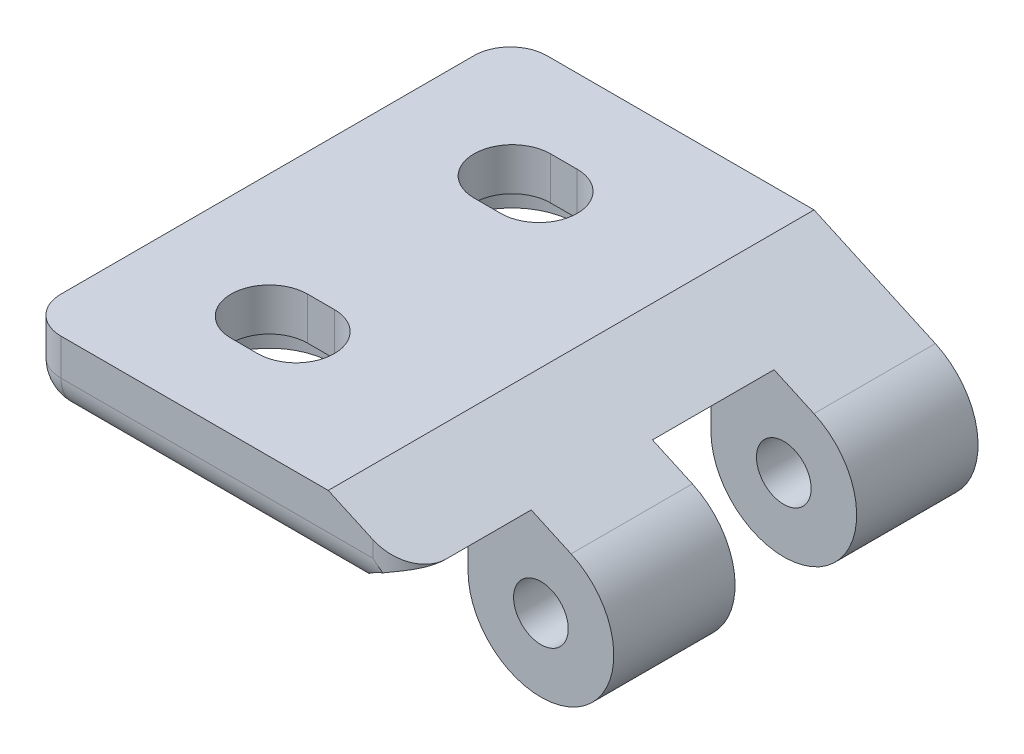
ISO-10303-21;
HEADER;
FILE_DESCRIPTION(('STEP AP214'),'2;1');
FILE_NAME('part.step','',(''),(''),'','','');
FILE_SCHEMA(('AUTOMOTIVE_DESIGN { 1 0 10303 214 1 1 1 1 }'));
ENDSEC;
DATA;
#1=APPLICATION_CONTEXT('core data for automotive mechanical design processes');
#2=APPLICATION_PROTOCOL_DEFINITION('international standard','automotive_design',2000,#1);
#3=PRODUCT_CONTEXT('',#1,'mechanical');
#4=PRODUCT('Part','Part','',(#3));
#5=PRODUCT_RELATED_PRODUCT_CATEGORY('part','',(#4));
#6=PRODUCT_DEFINITION_FORMATION('','',#4);
#7=PRODUCT_DEFINITION_CONTEXT('part definition',#1,'design');
#8=PRODUCT_DEFINITION('design','',#6,#7);
#9=PRODUCT_DEFINITION_SHAPE('','',#8);
#10=(LENGTH_UNIT() NAMED_UNIT(*) SI_UNIT(.MILLI.,.METRE.));
#11=(NAMED_UNIT(*) PLANE_ANGLE_UNIT() SI_UNIT($,.RADIAN.));
#12=(NAMED_UNIT(*) SI_UNIT($,.STERADIAN.) SOLID_ANGLE_UNIT());
#13=UNCERTAINTY_MEASURE_WITH_UNIT(LENGTH_MEASURE(1.E-05),#10,'distance_accuracy_value','');
#14=(GEOMETRIC_REPRESENTATION_CONTEXT(3) GLOBAL_UNCERTAINTY_ASSIGNED_CONTEXT((#13)) GLOBAL_UNIT_ASSIGNED_CONTEXT((#10,
#11,#12)) REPRESENTATION_CONTEXT('',''));
#15=CARTESIAN_POINT('',(0.,0.,0.));
#16=DIRECTION('',(0.,0.,1.));
#17=DIRECTION('',(1.,0.,0.));
#18=AXIS2_PLACEMENT_3D('',#15,#16,#17);
#19=CARTESIAN_POINT('',(21.25,70.0429419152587,10.));
#20=DIRECTION('',(0.,0.,-1.));
#21=DIRECTION('',(-1.,0.,0.));
#22=AXIS2_PLACEMENT_3D('',#19,#20,#21);
#23=CYLINDRICAL_SURFACE('',#22,2.2505);
#24=CARTESIAN_POINT('',(21.25,70.0429419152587,19.99));
#25=DIRECTION('',(0.,0.,-1.));
#26=DIRECTION('',(-1.,0.,0.));
#27=AXIS2_PLACEMENT_3D('',#24,#25,#26);
#28=CIRCLE('',#27,2.2505);
#29=CARTESIAN_POINT('',(18.9995,70.0429419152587,19.99));
#30=VERTEX_POINT('',#29);
#31=EDGE_CURVE('E377',#30,#30,#28,.F.);
#32=ORIENTED_EDGE('',*,*,#31,.T.);
#33=EDGE_LOOP('',(#32));
#34=FACE_BOUND('',#33,.T.);
#35=CARTESIAN_POINT('',(21.25,70.0429419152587,10.005));
#36=DIRECTION('',(0.,0.,-1.));
#37=DIRECTION('',(-1.,0.,0.));
#38=AXIS2_PLACEMENT_3D('',#35,#36,#37);
#39=CIRCLE('',#38,2.2505);
#40=CARTESIAN_POINT('',(18.9995,70.0429419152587,10.005));
#41=VERTEX_POINT('',#40);
#42=EDGE_CURVE('E639',#41,#41,#39,.T.);
#43=ORIENTED_EDGE('',*,*,#42,.T.);
#44=EDGE_LOOP('',(#43));
#45=FACE_BOUND('',#44,.T.);
#46=ADVANCED_FACE('F16',(#34,#45),#23,.F.);
#47=CARTESIAN_POINT('',(24.25,72.0429419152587,27.));
#48=DIRECTION('',(0.,0.,-1.));
#49=DIRECTION('',(-1.,0.,0.));
#50=AXIS2_PLACEMENT_3D('',#47,#48,#49);
#51=PLANE('',#50);
#52=DIRECTION('',(-1.,0.,0.));
#53=VECTOR('',#52,1.);
#54=CARTESIAN_POINT('',(24.25,74.0429419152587,27.));
#55=LINE('',#54,#53);
#56=CARTESIAN_POINT('',(15.25,74.0429419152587,27.));
#57=VERTEX_POINT('',#56);
#58=CARTESIAN_POINT('',(15.505437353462,74.0429419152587,27.));
#59=VERTEX_POINT('',#58);
#60=EDGE_CURVE('E274',#57,#59,#55,.F.);
#61=ORIENTED_EDGE('',*,*,#60,.F.);
#62=DIRECTION('',(0.,1.,0.));
#63=VECTOR('',#62,1.);
#64=CARTESIAN_POINT('',(15.25,74.0429419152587,27.));
#65=LINE('',#64,#63);
#66=CARTESIAN_POINT('',(15.25,73.6484931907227,27.));
#67=VERTEX_POINT('',#66);
#68=EDGE_CURVE('E253',#67,#57,#65,.T.);
#69=ORIENTED_EDGE('',*,*,#68,.F.);
#70=CARTESIAN_POINT('',(21.25,70.0429419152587,27.));
#71=DIRECTION('',(0.,0.,-1.));
#72=DIRECTION('',(-1.,0.,0.));
#73=AXIS2_PLACEMENT_3D('',#70,#71,#72);
#74=CIRCLE('',#73,7.);
#75=EDGE_CURVE('E597',#67,#59,#74,.T.);
#76=ORIENTED_EDGE('',*,*,#75,.T.);
#77=EDGE_LOOP('',(#61,#69,#76));
#78=FACE_BOUND('',#77,.T.);
#79=ADVANCED_FACE('F479',(#78),#51,.F.);
#80=CARTESIAN_POINT('',(-8.25,74.0429419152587,30.));
#81=DIRECTION('',(0.,-1.,0.));
#82=DIRECTION('',(0.,0.,-1.));
#83=AXIS2_PLACEMENT_3D('',#80,#81,#82);
#84=PLANE('',#83);
#85=CARTESIAN_POINT('',(1.1,74.0429419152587,20.));
#86=DIRECTION('',(0.,-1.,0.));
#87=DIRECTION('',(0.,0.,-1.));
#88=AXIS2_PLACEMENT_3D('',#85,#86,#87);
#89=CIRCLE('',#88,5.25);
#90=CARTESIAN_POINT('',(1.1,74.0429419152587,25.25));
#91=VERTEX_POINT('',#90);
#92=CARTESIAN_POINT('',(1.1,74.0429419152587,14.75));
#93=VERTEX_POINT('',#92);
#94=EDGE_CURVE('E801',#91,#93,#89,.F.);
#95=ORIENTED_EDGE('',*,*,#94,.T.);
#96=DIRECTION('',(-1.,0.,0.));
#97=VECTOR('',#96,1.);
#98=CARTESIAN_POINT('',(1.1,74.0429419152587,14.75));
#99=LINE('',#98,#97);
#100=CARTESIAN_POINT('',(-1.1,74.0429419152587,14.75));
#101=VERTEX_POINT('',#100);
#102=EDGE_CURVE('E289',#93,#101,#99,.T.);
#103=ORIENTED_EDGE('',*,*,#102,.T.);
#104=CARTESIAN_POINT('',(-1.1,74.0429419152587,20.));
#105=DIRECTION('',(0.,-1.,0.));
#106=DIRECTION('',(0.,0.,-1.));
#107=AXIS2_PLACEMENT_3D('',#104,#105,#106);
#108=CIRCLE('',#107,5.25);
#109=CARTESIAN_POINT('',(-1.1,74.0429419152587,25.25));
#110=VERTEX_POINT('',#109);
#111=EDGE_CURVE('E295',#101,#110,#108,.F.);
#112=ORIENTED_EDGE('',*,*,#111,.T.);
#113=DIRECTION('',(1.,0.,0.));
#114=VECTOR('',#113,1.);
#115=CARTESIAN_POINT('',(-1.1,74.0429419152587,25.25));
#116=LINE('',#115,#114);
#117=EDGE_CURVE('E285',#110,#91,#116,.T.);
#118=ORIENTED_EDGE('',*,*,#117,.T.);
#119=EDGE_LOOP('',(#95,#103,#112,#118));
#120=FACE_BOUND('',#119,.T.);
#121=CARTESIAN_POINT('',(1.1,74.0429419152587,0.));
#122=DIRECTION('',(0.,-1.,0.));
#123=DIRECTION('',(0.,0.,-1.));
#124=AXIS2_PLACEMENT_3D('',#121,#122,#123);
#125=CIRCLE('',#124,5.25);
#126=CARTESIAN_POINT('',(1.1,74.0429419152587,5.24999999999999));
#127=VERTEX_POINT('',#126);
#128=CARTESIAN_POINT('',(1.1,74.0429419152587,-5.25000000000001));
#129=VERTEX_POINT('',#128);
#130=EDGE_CURVE('E225',#127,#129,#125,.F.);
#131=ORIENTED_EDGE('',*,*,#130,.T.);
#132=DIRECTION('',(-1.,0.,0.));
#133=VECTOR('',#132,1.);
#134=CARTESIAN_POINT('',(1.10000000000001,74.0429419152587,-5.25000000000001));
#135=LINE('',#134,#133);
#136=CARTESIAN_POINT('',(-1.09999999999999,74.0429419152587,-5.25000000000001));
#137=VERTEX_POINT('',#136);
#138=EDGE_CURVE('E222',#129,#137,#135,.T.);
#139=ORIENTED_EDGE('',*,*,#138,.T.);
#140=CARTESIAN_POINT('',(-1.09999999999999,74.0429419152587,0.));
#141=DIRECTION('',(0.,-1.,0.));
#142=DIRECTION('',(0.,0.,-1.));
#143=AXIS2_PLACEMENT_3D('',#140,#141,#142);
#144=CIRCLE('',#143,5.25);
#145=CARTESIAN_POINT('',(-1.09999999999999,74.0429419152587,5.24999999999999));
#146=VERTEX_POINT('',#145);
#147=EDGE_CURVE('E19',#137,#146,#144,.F.);
#148=ORIENTED_EDGE('',*,*,#147,.T.);
#149=DIRECTION('',(1.,0.,0.));
#150=VECTOR('',#149,1.);
#151=CARTESIAN_POINT('',(-1.09999999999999,74.0429419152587,5.24999999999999));
#152=LINE('',#151,#150);
#153=EDGE_CURVE('E294',#146,#127,#152,.T.);
#154=ORIENTED_EDGE('',*,*,#153,.T.);
#155=EDGE_LOOP('',(#131,#139,#148,#154));
#156=FACE_BOUND('',#155,.T.);
#157=DIRECTION('',(-1.,0.,0.));
#158=VECTOR('',#157,1.);
#159=CARTESIAN_POINT('',(24.25,74.0429419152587,27.));
#160=LINE('',#159,#158);
#161=CARTESIAN_POINT('',(-8.25,74.0429419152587,26.9999999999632));
#162=VERTEX_POINT('',#161);
#163=EDGE_CURVE('E271',#162,#57,#160,.F.);
#164=ORIENTED_EDGE('',*,*,#163,.F.);
#165=DIRECTION('',(0.,0.,-1.));
#166=VECTOR('',#165,1.);
#167=CARTESIAN_POINT('',(-8.25,74.0429419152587,30.));
#168=LINE('',#167,#166);
#169=CARTESIAN_POINT('',(-8.25,74.0429419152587,-7.));
#170=VERTEX_POINT('',#169);
#171=EDGE_CURVE('E278',#170,#162,#168,.F.);
#172=ORIENTED_EDGE('',*,*,#171,.F.);
#173=DIRECTION('',(-1.,0.,0.));
#174=VECTOR('',#173,1.);
#175=CARTESIAN_POINT('',(15.25,74.0429419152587,-7.));
#176=LINE('',#175,#174);
#177=CARTESIAN_POINT('',(15.25,74.0429419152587,-7.));
#178=VERTEX_POINT('',#177);
#179=EDGE_CURVE('E243',#178,#170,#176,.T.);
#180=ORIENTED_EDGE('',*,*,#179,.F.);
#181=DIRECTION('',(0.,0.,1.));
#182=VECTOR('',#181,1.);
#183=CARTESIAN_POINT('',(15.25,74.0429419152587,30.));
#184=LINE('',#183,#182);
#185=EDGE_CURVE('E242',#57,#178,#184,.F.);
#186=ORIENTED_EDGE('',*,*,#185,.F.);
#187=EDGE_LOOP('',(#164,#172,#180,#186));
#188=FACE_BOUND('',#187,.T.);
#189=ADVANCED_FACE('F223',(#120,#156,#188),#84,.T.);
#190=CARTESIAN_POINT('',(-1.09999999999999,76.5429419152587,0.));
#191=DIRECTION('',(0.,-1.,0.));
#192=DIRECTION('',(0.,0.,-1.));
#193=AXIS2_PLACEMENT_3D('',#190,#191,#192);
#194=CYLINDRICAL_SURFACE('',#193,5.25);
#195=DIRECTION('',(0.,1.,0.));
#196=VECTOR('',#195,1.);
#197=CARTESIAN_POINT('',(-1.09999999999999,76.5429419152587,-5.25000000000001));
#198=LINE('',#197,#196);
#199=CARTESIAN_POINT('',(-1.09999999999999,76.5429419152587,-5.25000000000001));
#200=VERTEX_POINT('',#199);
#201=EDGE_CURVE('E214',#137,#200,#198,.T.);
#202=ORIENTED_EDGE('',*,*,#201,.T.);
#203=CARTESIAN_POINT('',(-1.09999999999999,76.5429419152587,0.));
#204=DIRECTION('',(0.,-1.,0.));
#205=DIRECTION('',(0.,0.,-1.));
#206=AXIS2_PLACEMENT_3D('',#203,#204,#205);
#207=CIRCLE('',#206,5.25);
#208=CARTESIAN_POINT('',(-1.09999999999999,76.5429419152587,5.25));
#209=VERTEX_POINT('',#208);
#210=EDGE_CURVE('E363',#209,#200,#207,.T.);
#211=ORIENTED_EDGE('',*,*,#210,.F.);
#212=DIRECTION('',(0.,1.,0.));
#213=VECTOR('',#212,1.);
#214=CARTESIAN_POINT('',(-1.09999999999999,76.5429419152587,5.24999999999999));
#215=LINE('',#214,#213);
#216=EDGE_CURVE('E217',#209,#146,#215,.F.);
#217=ORIENTED_EDGE('',*,*,#216,.T.);
#218=ORIENTED_EDGE('',*,*,#147,.F.);
#219=EDGE_LOOP('',(#202,#211,#217,#218));
#220=FACE_BOUND('',#219,.T.);
#221=ADVANCED_FACE('F212',(#220),#194,.F.);
#222=CARTESIAN_POINT('',(1.10000000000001,76.5429419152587,-5.25000000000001));
#223=DIRECTION('',(0.,0.,-1.));
#224=DIRECTION('',(-1.,0.,0.));
#225=AXIS2_PLACEMENT_3D('',#222,#223,#224);
#226=PLANE('',#225);
#227=DIRECTION('',(0.,-1.,0.));
#228=VECTOR('',#227,1.);
#229=CARTESIAN_POINT('',(1.1,76.5429419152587,-5.25000000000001));
#230=LINE('',#229,#228);
#231=CARTESIAN_POINT('',(1.1,76.5429419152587,-5.25000000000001));
#232=VERTEX_POINT('',#231);
#233=EDGE_CURVE('E228',#129,#232,#230,.F.);
#234=ORIENTED_EDGE('',*,*,#233,.T.);
#235=DIRECTION('',(1.,0.,0.));
#236=VECTOR('',#235,1.);
#237=CARTESIAN_POINT('',(0.,76.5429419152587,-5.25));
#238=LINE('',#237,#236);
#239=EDGE_CURVE('E232',#200,#232,#238,.T.);
#240=ORIENTED_EDGE('',*,*,#239,.F.);
#241=ORIENTED_EDGE('',*,*,#201,.F.);
#242=ORIENTED_EDGE('',*,*,#138,.F.);
#243=EDGE_LOOP('',(#234,#240,#241,#242));
#244=FACE_BOUND('',#243,.T.);
#245=ADVANCED_FACE('F230',(#244),#226,.F.);
#246=CARTESIAN_POINT('',(1.1,76.5429419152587,0.));
#247=DIRECTION('',(0.,-1.,0.));
#248=DIRECTION('',(0.,0.,-1.));
#249=AXIS2_PLACEMENT_3D('',#246,#247,#248);
#250=CYLINDRICAL_SURFACE('',#249,5.25);
#251=DIRECTION('',(0.,1.,0.));
#252=VECTOR('',#251,1.);
#253=CARTESIAN_POINT('',(1.1,76.5429419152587,5.24999999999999));
#254=LINE('',#253,#252);
#255=CARTESIAN_POINT('',(1.1,76.5429419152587,5.25));
#256=VERTEX_POINT('',#255);
#257=EDGE_CURVE('E808',#127,#256,#254,.T.);
#258=ORIENTED_EDGE('',*,*,#257,.T.);
#259=CARTESIAN_POINT('',(1.1,76.5429419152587,0.));
#260=DIRECTION('',(0.,-1.,0.));
#261=DIRECTION('',(0.,0.,-1.));
#262=AXIS2_PLACEMENT_3D('',#259,#260,#261);
#263=CIRCLE('',#262,5.25);
#264=EDGE_CURVE('E360',#232,#256,#263,.T.);
#265=ORIENTED_EDGE('',*,*,#264,.F.);
#266=ORIENTED_EDGE('',*,*,#233,.F.);
#267=ORIENTED_EDGE('',*,*,#130,.F.);
#268=EDGE_LOOP('',(#258,#265,#266,#267));
#269=FACE_BOUND('',#268,.T.);
#270=ADVANCED_FACE('F469',(#269),#250,.F.);
#271=CARTESIAN_POINT('',(-1.09999999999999,76.5429419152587,5.24999999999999));
#272=DIRECTION('',(0.,0.,1.));
#273=DIRECTION('',(1.,0.,0.));
#274=AXIS2_PLACEMENT_3D('',#271,#272,#273);
#275=PLANE('',#274);
#276=ORIENTED_EDGE('',*,*,#216,.F.);
#277=DIRECTION('',(1.,0.,0.));
#278=VECTOR('',#277,1.);
#279=CARTESIAN_POINT('',(0.,76.5429419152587,5.25));
#280=LINE('',#279,#278);
#281=EDGE_CURVE('E359',#256,#209,#280,.F.);
#282=ORIENTED_EDGE('',*,*,#281,.F.);
#283=ORIENTED_EDGE('',*,*,#257,.F.);
#284=ORIENTED_EDGE('',*,*,#153,.F.);
#285=EDGE_LOOP('',(#276,#282,#283,#284));
#286=FACE_BOUND('',#285,.T.);
#287=ADVANCED_FACE('F465',(#286),#275,.F.);
#288=CARTESIAN_POINT('',(-1.1,76.5429419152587,20.));
#289=DIRECTION('',(0.,-1.,0.));
#290=DIRECTION('',(0.,0.,-1.));
#291=AXIS2_PLACEMENT_3D('',#288,#289,#290);
#292=CYLINDRICAL_SURFACE('',#291,5.25);
#293=DIRECTION('',(0.,1.,0.));
#294=VECTOR('',#293,1.);
#295=CARTESIAN_POINT('',(-1.1,76.5429419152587,14.75));
#296=LINE('',#295,#294);
#297=CARTESIAN_POINT('',(-1.1,76.5429419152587,14.75));
#298=VERTEX_POINT('',#297);
#299=EDGE_CURVE('E293',#101,#298,#296,.T.);
#300=ORIENTED_EDGE('',*,*,#299,.T.);
#301=CARTESIAN_POINT('',(-1.1,76.5429419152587,20.));
#302=DIRECTION('',(0.,-1.,0.));
#303=DIRECTION('',(0.,0.,-1.));
#304=AXIS2_PLACEMENT_3D('',#301,#302,#303);
#305=CIRCLE('',#304,5.25);
#306=CARTESIAN_POINT('',(-1.1,76.5429419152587,25.25));
#307=VERTEX_POINT('',#306);
#308=EDGE_CURVE('E356',#307,#298,#305,.T.);
#309=ORIENTED_EDGE('',*,*,#308,.F.);
#310=DIRECTION('',(0.,1.,0.));
#311=VECTOR('',#310,1.);
#312=CARTESIAN_POINT('',(-1.1,76.5429419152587,25.25));
#313=LINE('',#312,#311);
#314=EDGE_CURVE('E288',#307,#110,#313,.F.);
#315=ORIENTED_EDGE('',*,*,#314,.T.);
#316=ORIENTED_EDGE('',*,*,#111,.F.);
#317=EDGE_LOOP('',(#300,#309,#315,#316));
#318=FACE_BOUND('',#317,.T.);
#319=ADVANCED_FACE('F461',(#318),#292,.F.);
#320=CARTESIAN_POINT('',(1.1,76.5429419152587,14.75));
#321=DIRECTION('',(0.,0.,-1.));
#322=DIRECTION('',(-1.,0.,0.));
#323=AXIS2_PLACEMENT_3D('',#320,#321,#322);
#324=PLANE('',#323);
#325=DIRECTION('',(0.,-1.,0.));
#326=VECTOR('',#325,1.);
#327=CARTESIAN_POINT('',(1.1,76.5429419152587,14.75));
#328=LINE('',#327,#326);
#329=CARTESIAN_POINT('',(1.1,76.5429419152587,14.75));
#330=VERTEX_POINT('',#329);
#331=EDGE_CURVE('E292',#93,#330,#328,.F.);
#332=ORIENTED_EDGE('',*,*,#331,.T.);
#333=DIRECTION('',(1.,0.,0.));
#334=VECTOR('',#333,1.);
#335=CARTESIAN_POINT('',(0.,76.5429419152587,14.75));
#336=LINE('',#335,#334);
#337=EDGE_CURVE('E355',#298,#330,#336,.T.);
#338=ORIENTED_EDGE('',*,*,#337,.F.);
#339=ORIENTED_EDGE('',*,*,#299,.F.);
#340=ORIENTED_EDGE('',*,*,#102,.F.);
#341=EDGE_LOOP('',(#332,#338,#339,#340));
#342=FACE_BOUND('',#341,.T.);
#343=ADVANCED_FACE('F457',(#342),#324,.F.);
#344=CARTESIAN_POINT('',(1.1,76.5429419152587,20.));
#345=DIRECTION('',(0.,-1.,0.));
#346=DIRECTION('',(0.,0.,-1.));
#347=AXIS2_PLACEMENT_3D('',#344,#345,#346);
#348=CYLINDRICAL_SURFACE('',#347,5.25);
#349=DIRECTION('',(0.,1.,0.));
#350=VECTOR('',#349,1.);
#351=CARTESIAN_POINT('',(1.1,76.5429419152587,25.25));
#352=LINE('',#351,#350);
#353=CARTESIAN_POINT('',(1.1,76.5429419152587,25.25));
#354=VERTEX_POINT('',#353);
#355=EDGE_CURVE('E444',#91,#354,#352,.T.);
#356=ORIENTED_EDGE('',*,*,#355,.T.);
#357=CARTESIAN_POINT('',(1.1,76.5429419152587,20.));
#358=DIRECTION('',(0.,-1.,0.));
#359=DIRECTION('',(0.,0.,-1.));
#360=AXIS2_PLACEMENT_3D('',#357,#358,#359);
#361=CIRCLE('',#360,5.25);
#362=EDGE_CURVE('E351',#330,#354,#361,.T.);
#363=ORIENTED_EDGE('',*,*,#362,.F.);
#364=ORIENTED_EDGE('',*,*,#331,.F.);
#365=ORIENTED_EDGE('',*,*,#94,.F.);
#366=EDGE_LOOP('',(#356,#363,#364,#365));
#367=FACE_BOUND('',#366,.T.);
#368=ADVANCED_FACE('F453',(#367),#348,.F.);
#369=CARTESIAN_POINT('',(-1.1,76.5429419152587,25.25));
#370=DIRECTION('',(0.,0.,1.));
#371=DIRECTION('',(1.,0.,0.));
#372=AXIS2_PLACEMENT_3D('',#369,#370,#371);
#373=PLANE('',#372);
#374=ORIENTED_EDGE('',*,*,#314,.F.);
#375=DIRECTION('',(1.,0.,0.));
#376=VECTOR('',#375,1.);
#377=CARTESIAN_POINT('',(0.,76.5429419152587,25.25));
#378=LINE('',#377,#376);
#379=EDGE_CURVE('E354',#354,#307,#378,.F.);
#380=ORIENTED_EDGE('',*,*,#379,.F.);
#381=ORIENTED_EDGE('',*,*,#355,.F.);
#382=ORIENTED_EDGE('',*,*,#117,.F.);
#383=EDGE_LOOP('',(#374,#380,#381,#382));
#384=FACE_BOUND('',#383,.T.);
#385=ADVANCED_FACE('F449',(#384),#373,.F.);
#386=CARTESIAN_POINT('',(-8.25,77.0429419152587,-7.));
#387=DIRECTION('',(-1.,0.,0.));
#388=DIRECTION('',(0.,1.,0.));
#389=AXIS2_PLACEMENT_3D('',#386,#387,#388);
#390=SPHERICAL_SURFACE('',#389,3.);
#391=CARTESIAN_POINT('',(-8.25,77.0429419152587,-7.00000000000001));
#392=DIRECTION('',(0.,-1.,0.));
#393=DIRECTION('',(1.,0.,0.));
#394=AXIS2_PLACEMENT_3D('',#391,#392,#393);
#395=CIRCLE('',#394,3.);
#396=CARTESIAN_POINT('',(-8.25,77.0429419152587,-10.));
#397=VERTEX_POINT('',#396);
#398=CARTESIAN_POINT('',(-11.25,77.0429419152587,-7.));
#399=VERTEX_POINT('',#398);
#400=EDGE_CURVE('E650',#397,#399,#395,.F.);
#401=ORIENTED_EDGE('',*,*,#400,.F.);
#402=CARTESIAN_POINT('',(-8.25,77.0429419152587,-7.));
#403=DIRECTION('',(-1.,0.,0.));
#404=DIRECTION('',(0.,0.,1.));
#405=AXIS2_PLACEMENT_3D('',#402,#403,#404);
#406=CIRCLE('',#405,3.);
#407=EDGE_CURVE('E252',#170,#397,#406,.F.);
#408=ORIENTED_EDGE('',*,*,#407,.F.);
#409=CARTESIAN_POINT('',(-8.25,77.0429419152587,-7.));
#410=DIRECTION('',(0.,0.,-1.));
#411=DIRECTION('',(-1.,0.,0.));
#412=AXIS2_PLACEMENT_3D('',#409,#410,#411);
#413=CIRCLE('',#412,3.);
#414=EDGE_CURVE('E282',#399,#170,#413,.F.);
#415=ORIENTED_EDGE('',*,*,#414,.F.);
#416=EDGE_LOOP('',(#401,#408,#415));
#417=FACE_BOUND('',#416,.T.);
#418=ADVANCED_FACE('F446',(#417),#390,.T.);
#419=CARTESIAN_POINT('',(-8.25,77.0429419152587,30.));
#420=DIRECTION('',(0.,0.,-1.));
#421=DIRECTION('',(-1.,0.,0.));
#422=AXIS2_PLACEMENT_3D('',#419,#420,#421);
#423=CYLINDRICAL_SURFACE('',#422,3.);
#424=CARTESIAN_POINT('',(-8.25,77.0429419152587,27.));
#425=DIRECTION('',(0.,-4.90653188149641E-11,1.));
#426=DIRECTION('',(-1.,0.,0.));
#427=AXIS2_PLACEMENT_3D('',#424,#425,#426);
#428=CIRCLE('',#427,3.);
#429=CARTESIAN_POINT('',(-11.25,77.0429419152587,27.));
#430=VERTEX_POINT('',#429);
#431=EDGE_CURVE('E281',#430,#162,#428,.T.);
#432=ORIENTED_EDGE('',*,*,#431,.F.);
#433=DIRECTION('',(0.,0.,1.));
#434=VECTOR('',#433,1.);
#435=CARTESIAN_POINT('',(-11.25,77.0429419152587,30.));
#436=LINE('',#435,#434);
#437=EDGE_CURVE('E634',#399,#430,#436,.T.);
#438=ORIENTED_EDGE('',*,*,#437,.F.);
#439=ORIENTED_EDGE('',*,*,#414,.T.);
#440=ORIENTED_EDGE('',*,*,#171,.T.);
#441=EDGE_LOOP('',(#432,#438,#439,#440));
#442=FACE_BOUND('',#441,.T.);
#443=ADVANCED_FACE('F426',(#442),#423,.T.);
#444=CARTESIAN_POINT('',(-8.25,77.0429419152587,27.));
#445=DIRECTION('',(-1.,0.,0.));
#446=DIRECTION('',(0.,1.,0.));
#447=AXIS2_PLACEMENT_3D('',#444,#445,#446);
#448=SPHERICAL_SURFACE('',#447,3.);
#449=CARTESIAN_POINT('',(-8.25,77.0429419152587,27.));
#450=DIRECTION('',(-1.,0.,0.));
#451=DIRECTION('',(0.,0.,1.));
#452=AXIS2_PLACEMENT_3D('',#449,#450,#451);
#453=CIRCLE('',#452,3.);
#454=CARTESIAN_POINT('',(-8.25,77.0429419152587,30.));
#455=VERTEX_POINT('',#454);
#456=EDGE_CURVE('E275',#455,#162,#453,.F.);
#457=ORIENTED_EDGE('',*,*,#456,.F.);
#458=CARTESIAN_POINT('',(-8.25,77.0429419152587,27.));
#459=DIRECTION('',(0.,-1.,0.));
#460=DIRECTION('',(0.,0.,-1.));
#461=AXIS2_PLACEMENT_3D('',#458,#459,#460);
#462=CIRCLE('',#461,3.);
#463=EDGE_CURVE('E631',#430,#455,#462,.F.);
#464=ORIENTED_EDGE('',*,*,#463,.F.);
#465=ORIENTED_EDGE('',*,*,#431,.T.);
#466=EDGE_LOOP('',(#457,#464,#465));
#467=FACE_BOUND('',#466,.T.);
#468=ADVANCED_FACE('F421',(#467),#448,.T.);
#469=CARTESIAN_POINT('',(24.25,77.0429419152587,27.));
#470=DIRECTION('',(-1.,0.,0.));
#471=DIRECTION('',(0.,0.,1.));
#472=AXIS2_PLACEMENT_3D('',#469,#470,#471);
#473=CYLINDRICAL_SURFACE('',#472,3.);
#474=ORIENTED_EDGE('',*,*,#163,.T.);
#475=ORIENTED_EDGE('',*,*,#60,.T.);
#476=CARTESIAN_POINT('',(15.505437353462,74.0429419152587,27.));
#477=CARTESIAN_POINT('',(15.5054388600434,74.0429294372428,27.0708599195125));
#478=CARTESIAN_POINT('',(15.5071855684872,74.0454522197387,27.141715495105));
#479=CARTESIAN_POINT('',(15.5141783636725,74.0554745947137,27.2828896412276));
#480=CARTESIAN_POINT('',(15.5194239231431,74.0629734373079,27.3532082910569));
#481=CARTESIAN_POINT('',(15.5334042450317,74.0828270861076,27.4926110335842));
#482=CARTESIAN_POINT('',(15.54212942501,74.0951685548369,27.5616979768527));
#483=CARTESIAN_POINT('',(15.5630742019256,74.1245099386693,27.698315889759));
#484=CARTESIAN_POINT('',(15.5752938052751,74.1415098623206,27.7658468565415));
#485=CARTESIAN_POINT('',(15.6172237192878,74.199156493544,27.9653950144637));
#486=CARTESIAN_POINT('',(15.6522167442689,74.246467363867,28.0944855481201));
#487=CARTESIAN_POINT('',(15.7361960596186,74.3560255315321,28.341171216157));
#488=CARTESIAN_POINT('',(15.7851856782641,74.4182763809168,28.4587636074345));
#489=CARTESIAN_POINT('',(15.8979214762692,74.5555111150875,28.6823314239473));
#490=CARTESIAN_POINT('',(15.9619489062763,74.6307293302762,28.7880201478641));
#491=CARTESIAN_POINT('',(16.1032961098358,74.7887437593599,28.983532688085));
#492=CARTESIAN_POINT('',(16.1806134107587,74.8715385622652,29.0733594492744));
#493=CARTESIAN_POINT('',(16.3200767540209,75.0130828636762,29.210428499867));
#494=CARTESIAN_POINT('',(16.3789854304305,75.0709007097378,29.2620221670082));
#495=CARTESIAN_POINT('',(16.5018144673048,75.1870522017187,29.3582532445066));
#496=CARTESIAN_POINT('',(16.5657363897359,75.2453860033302,29.4028884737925));
#497=CARTESIAN_POINT('',(16.6983612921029,75.3618146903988,29.4857477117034));
#498=CARTESIAN_POINT('',(16.7670830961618,75.4199075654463,29.5239442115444));
#499=CARTESIAN_POINT('',(16.9086060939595,75.5348096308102,29.5942386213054));
#500=CARTESIAN_POINT('',(16.981408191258,75.5916185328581,29.6263351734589));
#501=CARTESIAN_POINT('',(17.1411416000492,75.7111498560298,29.6891467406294));
#502=CARTESIAN_POINT('',(17.2286187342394,75.7735782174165,29.719030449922));
#503=CARTESIAN_POINT('',(17.4076998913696,75.8951599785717,29.7725455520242));
#504=CARTESIAN_POINT('',(17.4993057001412,75.954311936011,29.7961742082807));
#505=CARTESIAN_POINT('',(17.6851139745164,76.0681662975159,29.8378614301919));
#506=CARTESIAN_POINT('',(17.779280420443,76.122907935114,29.855974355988));
#507=CARTESIAN_POINT('',(17.9705319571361,76.228169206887,29.8877566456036));
#508=CARTESIAN_POINT('',(18.0676134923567,76.2786937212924,29.9014312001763));
#509=CARTESIAN_POINT('',(18.1659846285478,76.3269572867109,29.9133084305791));
#510=B_SPLINE_CURVE_WITH_KNOTS('',3,(#476,#477,#478,#479,#480,#481,#482,#483,#484,#485,#486,
#487,#488,#489,#490,#491,#492,#493,#494,#495,#496,#497,#498,#499,#500,#501,#502,#503,#504,#505,
#506,#507,#508,#509),.UNSPECIFIED.,.F.,.F.,(4,2,2,2,2,2,2,2,2,2,2,2,2,2,2,2,4),(0.,
0.212505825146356,0.424979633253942,0.636872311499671,0.848765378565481,1.2721964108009,
1.69572821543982,2.12792013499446,2.56003173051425,2.85169000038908,3.14343950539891,
3.4364055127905,3.72943665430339,4.06374015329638,4.39818966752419,4.72922756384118,
5.05987689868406),.UNSPECIFIED.);
#511=CARTESIAN_POINT('',(18.1659846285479,76.3269572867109,29.9133084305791));
#512=VERTEX_POINT('',#511);
#513=EDGE_CURVE('E385',#59,#512,#510,.T.);
#514=ORIENTED_EDGE('',*,*,#513,.T.);
#515=CARTESIAN_POINT('',(17.45,77.0429419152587,27.));
#516=DIRECTION('',(-0.707106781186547,-0.707106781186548,0.));
#517=DIRECTION('',(0.707106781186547,-0.707106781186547,0.));
#518=AXIS2_PLACEMENT_3D('',#515,#516,#517);
#519=ELLIPSE('',#518,4.24264068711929,3.);
#520=CARTESIAN_POINT('',(17.45,77.0429419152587,30.));
#521=VERTEX_POINT('',#520);
#522=EDGE_CURVE('E759',#521,#512,#519,.F.);
#523=ORIENTED_EDGE('',*,*,#522,.F.);
#524=DIRECTION('',(-1.,0.,0.));
#525=VECTOR('',#524,1.);
#526=CARTESIAN_POINT('',(8.98147180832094,77.0429419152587,30.));
#527=LINE('',#526,#525);
#528=EDGE_CURVE('E625',#521,#455,#527,.T.);
#529=ORIENTED_EDGE('',*,*,#528,.T.);
#530=ORIENTED_EDGE('',*,*,#456,.T.);
#531=EDGE_LOOP('',(#474,#475,#514,#523,#529,#530));
#532=FACE_BOUND('',#531,.T.);
#533=ADVANCED_FACE('F416',(#532),#473,.T.);
#534=CARTESIAN_POINT('',(21.25,70.0429419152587,10.005));
#535=DIRECTION('',(0.,0.,1.));
#536=DIRECTION('',(1.,0.,0.));
#537=AXIS2_PLACEMENT_3D('',#534,#535,#536);
#538=PLANE('',#537);
#539=ORIENTED_EDGE('',*,*,#42,.F.);
#540=EDGE_LOOP('',(#539));
#541=FACE_BOUND('',#540,.T.);
#542=CARTESIAN_POINT('',(21.25,70.0429419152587,10.005));
#543=DIRECTION('',(0.,0.,-1.));
#544=DIRECTION('',(-1.,0.,0.));
#545=AXIS2_PLACEMENT_3D('',#542,#543,#544);
#546=CIRCLE('',#545,6.);
#547=CARTESIAN_POINT('',(15.25,70.0429419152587,10.005));
#548=VERTEX_POINT('',#547);
#549=CARTESIAN_POINT('',(23.7328887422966,75.5051084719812,10.005));
#550=VERTEX_POINT('',#549);
#551=EDGE_CURVE('E374',#548,#550,#546,.F.);
#552=ORIENTED_EDGE('',*,*,#551,.F.);
#553=DIRECTION('',(0.,1.,0.));
#554=VECTOR('',#553,1.);
#555=CARTESIAN_POINT('',(15.25,74.0429419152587,10.005));
#556=LINE('',#555,#554);
#557=CARTESIAN_POINT('',(15.25,73.6484931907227,10.005));
#558=VERTEX_POINT('',#557);
#559=EDGE_CURVE('E267',#558,#548,#556,.F.);
#560=ORIENTED_EDGE('',*,*,#559,.F.);
#561=CARTESIAN_POINT('',(21.25,70.0429419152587,10.005));
#562=DIRECTION('',(0.,0.,-1.));
#563=DIRECTION('',(-1.,0.,0.));
#564=AXIS2_PLACEMENT_3D('',#561,#562,#563);
#565=CIRCLE('',#564,7.);
#566=CARTESIAN_POINT('',(20.4505351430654,76.9971389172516,10.005));
#567=VERTEX_POINT('',#566);
#568=EDGE_CURVE('E817',#558,#567,#565,.T.);
#569=ORIENTED_EDGE('',*,*,#568,.T.);
#570=DIRECTION('',(-0.910361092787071,0.413814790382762,0.));
#571=VECTOR('',#570,1.);
#572=CARTESIAN_POINT('',(23.7328887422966,75.5051084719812,10.005));
#573=LINE('',#572,#571);
#574=EDGE_CURVE('E615',#550,#567,#573,.T.);
#575=ORIENTED_EDGE('',*,*,#574,.F.);
#576=EDGE_LOOP('',(#552,#560,#569,#575));
#577=FACE_BOUND('',#576,.T.);
#578=ADVANCED_FACE('F413',(#541,#577),#538,.F.);
#579=CARTESIAN_POINT('',(21.25,70.0429419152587,5.));
#580=DIRECTION('',(0.,0.,-1.));
#581=DIRECTION('',(-1.,0.,0.));
#582=AXIS2_PLACEMENT_3D('',#579,#580,#581);
#583=CYLINDRICAL_SURFACE('',#582,7.);
#584=ORIENTED_EDGE('',*,*,#568,.F.);
#585=DIRECTION('',(0.,0.,1.));
#586=VECTOR('',#585,1.);
#587=CARTESIAN_POINT('',(15.25,73.6484931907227,30.));
#588=LINE('',#587,#586);
#589=CARTESIAN_POINT('',(15.25,73.6484931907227,-0.0050000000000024));
#590=VERTEX_POINT('',#589);
#591=EDGE_CURVE('E241',#590,#558,#588,.T.);
#592=ORIENTED_EDGE('',*,*,#591,.F.);
#593=CARTESIAN_POINT('',(21.25,70.0429419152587,-0.00500000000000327));
#594=DIRECTION('',(0.,0.,-1.));
#595=DIRECTION('',(-1.,0.,0.));
#596=AXIS2_PLACEMENT_3D('',#593,#594,#595);
#597=CIRCLE('',#596,7.);
#598=CARTESIAN_POINT('',(20.4505351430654,76.9971389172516,-0.0050000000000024));
#599=VERTEX_POINT('',#598);
#600=EDGE_CURVE('E819',#590,#599,#597,.T.);
#601=ORIENTED_EDGE('',*,*,#600,.T.);
#602=DIRECTION('',(0.,0.,1.));
#603=VECTOR('',#602,1.);
#604=CARTESIAN_POINT('',(20.4505351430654,76.9971389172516,30.));
#605=LINE('',#604,#603);
#606=EDGE_CURVE('E621',#567,#599,#605,.F.);
#607=ORIENTED_EDGE('',*,*,#606,.F.);
#608=EDGE_LOOP('',(#584,#592,#601,#607));
#609=FACE_BOUND('',#608,.T.);
#610=ADVANCED_FACE('F409',(#609),#583,.F.);
#611=CARTESIAN_POINT('',(21.25,70.0429419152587,-0.005000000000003));
#612=DIRECTION('',(0.,0.,-1.));
#613=DIRECTION('',(-1.,0.,0.));
#614=AXIS2_PLACEMENT_3D('',#611,#612,#613);
#615=PLANE('',#614);
#616=CARTESIAN_POINT('',(21.25,70.0429419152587,-0.00500000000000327));
#617=DIRECTION('',(0.,0.,-1.));
#618=DIRECTION('',(-1.,0.,0.));
#619=AXIS2_PLACEMENT_3D('',#616,#617,#618);
#620=CIRCLE('',#619,2.2505);
#621=CARTESIAN_POINT('',(18.9995,70.0429419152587,-0.00500000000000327));
#622=VERTEX_POINT('',#621);
#623=EDGE_CURVE('E365',#622,#622,#620,.T.);
#624=ORIENTED_EDGE('',*,*,#623,.T.);
#625=EDGE_LOOP('',(#624));
#626=FACE_BOUND('',#625,.T.);
#627=ORIENTED_EDGE('',*,*,#600,.F.);
#628=DIRECTION('',(0.,1.,0.));
#629=VECTOR('',#628,1.);
#630=CARTESIAN_POINT('',(15.25,74.0429419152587,-0.00500000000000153));
#631=LINE('',#630,#629);
#632=CARTESIAN_POINT('',(15.25,70.0429419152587,-0.00500000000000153));
#633=VERTEX_POINT('',#632);
#634=EDGE_CURVE('E238',#633,#590,#631,.T.);
#635=ORIENTED_EDGE('',*,*,#634,.F.);
#636=CARTESIAN_POINT('',(21.25,70.0429419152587,-0.00500000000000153));
#637=DIRECTION('',(0.,0.,-1.));
#638=DIRECTION('',(-1.,0.,0.));
#639=AXIS2_PLACEMENT_3D('',#636,#637,#638);
#640=CIRCLE('',#639,6.);
#641=CARTESIAN_POINT('',(23.7328887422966,75.5051084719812,-0.00500000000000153));
#642=VERTEX_POINT('',#641);
#643=EDGE_CURVE('E246',#642,#633,#640,.T.);
#644=ORIENTED_EDGE('',*,*,#643,.F.);
#645=DIRECTION('',(-0.910361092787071,0.413814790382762,0.));
#646=VECTOR('',#645,1.);
#647=CARTESIAN_POINT('',(23.7328887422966,75.5051084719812,-0.00500000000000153));
#648=LINE('',#647,#646);
#649=EDGE_CURVE('E617',#599,#642,#648,.F.);
#650=ORIENTED_EDGE('',*,*,#649,.F.);
#651=EDGE_LOOP('',(#627,#635,#644,#650));
#652=FACE_BOUND('',#651,.T.);
#653=ADVANCED_FACE('F405',(#626,#652),#615,.F.);
#654=CARTESIAN_POINT('',(17.45,80.0429419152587,27.));
#655=DIRECTION('',(0.,-1.,0.));
#656=DIRECTION('',(1.,0.,0.));
#657=AXIS2_PLACEMENT_3D('',#654,#655,#656);
#658=CYLINDRICAL_SURFACE('',#657,3.);
#659=DIRECTION('',(0.,1.,0.));
#660=VECTOR('',#659,1.);
#661=CARTESIAN_POINT('',(17.45,74.6591970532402,30.));
#662=LINE('',#661,#660);
#663=CARTESIAN_POINT('',(17.45,78.3610656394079,30.));
#664=VERTEX_POINT('',#663);
#665=EDGE_CURVE('E612',#664,#521,#662,.F.);
#666=ORIENTED_EDGE('',*,*,#665,.T.);
#667=ORIENTED_EDGE('',*,*,#522,.T.);
#668=CARTESIAN_POINT('',(18.1659846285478,76.3269572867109,29.9133084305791));
#669=CARTESIAN_POINT('',(18.2385372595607,76.362578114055,29.8954905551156));
#670=CARTESIAN_POINT('',(18.3111542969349,76.3966434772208,29.8747573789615));
#671=CARTESIAN_POINT('',(18.4558955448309,76.4616043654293,29.8273584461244));
#672=CARTESIAN_POINT('',(18.5280195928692,76.4924988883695,29.8006908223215));
#673=CARTESIAN_POINT('',(18.6710864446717,76.5510283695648,29.7413405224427));
#674=CARTESIAN_POINT('',(18.7420295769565,76.5786642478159,29.7086595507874));
#675=CARTESIAN_POINT('',(18.8820576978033,76.6306899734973,29.6373060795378));
#676=CARTESIAN_POINT('',(18.9511429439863,76.655080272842,29.5986344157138));
#677=CARTESIAN_POINT('',(19.0869361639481,76.7007418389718,29.5153131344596));
#678=CARTESIAN_POINT('',(19.1536381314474,76.7220055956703,29.4706496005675));
#679=CARTESIAN_POINT('',(19.2838377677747,76.7614861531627,29.3756133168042));
#680=CARTESIAN_POINT('',(19.3473342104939,76.7797017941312,29.3252384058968));
#681=CARTESIAN_POINT('',(19.4703827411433,76.8132465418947,29.2191530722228));
#682=CARTESIAN_POINT('',(19.529939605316,76.828579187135,29.1634493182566));
#683=CARTESIAN_POINT('',(19.6446198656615,76.8566224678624,29.0470306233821));
#684=CARTESIAN_POINT('',(19.6997416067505,76.8693321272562,28.9863138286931));
#685=CARTESIAN_POINT('',(19.8547070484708,76.903272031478,28.8007755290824));
#686=CARTESIAN_POINT('',(19.9477074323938,76.9212353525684,28.6694949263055));
#687=CARTESIAN_POINT('',(20.111784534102,76.9502903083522,28.3931253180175));
#688=CARTESIAN_POINT('',(20.1828394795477,76.9613751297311,28.248022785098));
#689=CARTESIAN_POINT('',(20.3019176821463,76.9787065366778,27.9452616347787));
#690=CARTESIAN_POINT('',(20.3494886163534,76.9848594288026,27.7874198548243));
#691=CARTESIAN_POINT('',(20.418074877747,76.9934202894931,27.4662543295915));
#692=CARTESIAN_POINT('',(20.4391491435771,76.9958365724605,27.3029435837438));
#693=CARTESIAN_POINT('',(20.4489275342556,76.996950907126,27.0928101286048));
#694=CARTESIAN_POINT('',(20.4500065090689,76.9970726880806,27.0463948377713));
#695=CARTESIAN_POINT('',(20.45,76.9970773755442,26.9999999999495));
#696=B_SPLINE_CURVE_WITH_KNOTS('',3,(#668,#669,#670,#671,#672,#673,#674,#675,#676,#677,#678,
#679,#680,#681,#682,#683,#684,#685,#686,#687,#688,#689,#690,#691,#692,#693,#694,#695),
.UNSPECIFIED.,.F.,.F.,(4,2,2,2,2,2,2,2,2,2,2,2,2,4),(0.,0.248254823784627,0.496587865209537,
0.744850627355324,0.993078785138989,1.24189378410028,1.4908032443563,1.73940518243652,
1.98809946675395,2.47130898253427,2.95499636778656,3.44766811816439,3.93924202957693,
4.07846990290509),.UNSPECIFIED.);
#697=CARTESIAN_POINT('',(20.4501968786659,76.9972040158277,27.));
#698=VERTEX_POINT('',#697);
#699=EDGE_CURVE('E382',#512,#698,#696,.T.);
#700=ORIENTED_EDGE('',*,*,#699,.T.);
#701=CARTESIAN_POINT('',(17.45,78.3610656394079,27.));
#702=DIRECTION('',(0.413814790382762,0.910361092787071,0.));
#703=DIRECTION('',(0.910361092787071,-0.413814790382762,0.));
#704=AXIS2_PLACEMENT_3D('',#701,#702,#703);
#705=ELLIPSE('',#704,3.29539566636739,3.);
#706=EDGE_CURVE('E344',#664,#698,#705,.T.);
#707=ORIENTED_EDGE('',*,*,#706,.F.);
#708=EDGE_LOOP('',(#666,#667,#700,#707));
#709=FACE_BOUND('',#708,.T.);
#710=ADVANCED_FACE('F401',(#709),#658,.T.);
#711=CARTESIAN_POINT('',(21.25,70.0429419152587,24.995));
#712=DIRECTION('',(0.,0.,-1.));
#713=DIRECTION('',(-1.,0.,0.));
#714=AXIS2_PLACEMENT_3D('',#711,#712,#713);
#715=CYLINDRICAL_SURFACE('',#714,7.);
#716=ORIENTED_EDGE('',*,*,#699,.F.);
#717=ORIENTED_EDGE('',*,*,#513,.F.);
#718=ORIENTED_EDGE('',*,*,#75,.F.);
#719=DIRECTION('',(0.,0.,1.));
#720=VECTOR('',#719,1.);
#721=CARTESIAN_POINT('',(15.25,73.6484931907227,30.));
#722=LINE('',#721,#720);
#723=CARTESIAN_POINT('',(15.25,73.6484931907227,19.99));
#724=VERTEX_POINT('',#723);
#725=EDGE_CURVE('E256',#724,#67,#722,.T.);
#726=ORIENTED_EDGE('',*,*,#725,.F.);
#727=CARTESIAN_POINT('',(21.25,70.0429419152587,19.99));
#728=DIRECTION('',(0.,0.,-1.));
#729=DIRECTION('',(-1.,0.,0.));
#730=AXIS2_PLACEMENT_3D('',#727,#728,#729);
#731=CIRCLE('',#730,7.);
#732=CARTESIAN_POINT('',(20.4505351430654,76.9971389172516,19.99));
#733=VERTEX_POINT('',#732);
#734=EDGE_CURVE('E380',#724,#733,#731,.T.);
#735=ORIENTED_EDGE('',*,*,#734,.T.);
#736=DIRECTION('',(0.,0.,1.));
#737=VECTOR('',#736,1.);
#738=CARTESIAN_POINT('',(20.4505351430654,76.9971389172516,30.));
#739=LINE('',#738,#737);
#740=EDGE_CURVE('E347',#698,#733,#739,.F.);
#741=ORIENTED_EDGE('',*,*,#740,.F.);
#742=EDGE_LOOP('',(#716,#717,#718,#726,#735,#741));
#743=FACE_BOUND('',#742,.T.);
#744=ADVANCED_FACE('F398',(#743),#715,.F.);
#745=CARTESIAN_POINT('',(21.25,70.0429419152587,19.99));
#746=DIRECTION('',(0.,0.,-1.));
#747=DIRECTION('',(-1.,0.,0.));
#748=AXIS2_PLACEMENT_3D('',#745,#746,#747);
#749=PLANE('',#748);
#750=ORIENTED_EDGE('',*,*,#31,.F.);
#751=EDGE_LOOP('',(#750));
#752=FACE_BOUND('',#751,.T.);
#753=ORIENTED_EDGE('',*,*,#734,.F.);
#754=DIRECTION('',(0.,1.,0.));
#755=VECTOR('',#754,1.);
#756=CARTESIAN_POINT('',(15.25,74.0429419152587,19.99));
#757=LINE('',#756,#755);
#758=CARTESIAN_POINT('',(15.25,70.0429419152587,19.99));
#759=VERTEX_POINT('',#758);
#760=EDGE_CURVE('E261',#759,#724,#757,.T.);
#761=ORIENTED_EDGE('',*,*,#760,.F.);
#762=CARTESIAN_POINT('',(21.25,70.0429419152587,19.99));
#763=DIRECTION('',(0.,0.,-1.));
#764=DIRECTION('',(-1.,0.,0.));
#765=AXIS2_PLACEMENT_3D('',#762,#763,#764);
#766=CIRCLE('',#765,6.);
#767=CARTESIAN_POINT('',(23.7328887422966,75.5051084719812,19.99));
#768=VERTEX_POINT('',#767);
#769=EDGE_CURVE('E270',#768,#759,#766,.T.);
#770=ORIENTED_EDGE('',*,*,#769,.F.);
#771=DIRECTION('',(-0.910361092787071,0.413814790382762,0.));
#772=VECTOR('',#771,1.);
#773=CARTESIAN_POINT('',(23.7328887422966,75.5051084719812,19.99));
#774=LINE('',#773,#772);
#775=EDGE_CURVE('E592',#733,#768,#774,.F.);
#776=ORIENTED_EDGE('',*,*,#775,.F.);
#777=EDGE_LOOP('',(#753,#761,#770,#776));
#778=FACE_BOUND('',#777,.T.);
#779=ADVANCED_FACE('F578',(#752,#778),#749,.F.);
#780=CARTESIAN_POINT('',(21.25,70.0429419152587,30.));
#781=DIRECTION('',(0.,0.,-1.));
#782=DIRECTION('',(-1.,0.,0.));
#783=AXIS2_PLACEMENT_3D('',#780,#781,#782);
#784=CYLINDRICAL_SURFACE('',#783,6.);
#785=ORIENTED_EDGE('',*,*,#769,.T.);
#786=DIRECTION('',(0.,0.,1.));
#787=VECTOR('',#786,1.);
#788=CARTESIAN_POINT('',(15.25,70.0429419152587,30.));
#789=LINE('',#788,#787);
#790=EDGE_CURVE('E264',#548,#759,#789,.T.);
#791=ORIENTED_EDGE('',*,*,#790,.F.);
#792=ORIENTED_EDGE('',*,*,#551,.T.);
#793=DIRECTION('',(0.,0.,1.));
#794=VECTOR('',#793,1.);
#795=CARTESIAN_POINT('',(23.7328887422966,75.5051084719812,30.));
#796=LINE('',#795,#794);
#797=EDGE_CURVE('E602',#768,#550,#796,.F.);
#798=ORIENTED_EDGE('',*,*,#797,.F.);
#799=EDGE_LOOP('',(#785,#791,#792,#798));
#800=FACE_BOUND('',#799,.T.);
#801=ADVANCED_FACE('F575',(#800),#784,.T.);
#802=CARTESIAN_POINT('',(15.25,74.0429419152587,30.));
#803=DIRECTION('',(-1.,0.,0.));
#804=DIRECTION('',(0.,0.,1.));
#805=AXIS2_PLACEMENT_3D('',#802,#803,#804);
#806=PLANE('',#805);
#807=ORIENTED_EDGE('',*,*,#634,.T.);
#808=ORIENTED_EDGE('',*,*,#591,.T.);
#809=ORIENTED_EDGE('',*,*,#559,.T.);
#810=ORIENTED_EDGE('',*,*,#790,.T.);
#811=ORIENTED_EDGE('',*,*,#760,.T.);
#812=ORIENTED_EDGE('',*,*,#725,.T.);
#813=ORIENTED_EDGE('',*,*,#68,.T.);
#814=ORIENTED_EDGE('',*,*,#185,.T.);
#815=CARTESIAN_POINT('',(15.25,77.0429419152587,-7.));
#816=DIRECTION('',(-1.,0.,0.));
#817=DIRECTION('',(0.,0.,1.));
#818=AXIS2_PLACEMENT_3D('',#815,#816,#817);
#819=CIRCLE('',#818,3.);
#820=CARTESIAN_POINT('',(15.25,77.0429419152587,-10.));
#821=VERTEX_POINT('',#820);
#822=EDGE_CURVE('E247',#821,#178,#819,.T.);
#823=ORIENTED_EDGE('',*,*,#822,.F.);
#824=DIRECTION('',(0.,1.,0.));
#825=VECTOR('',#824,1.);
#826=CARTESIAN_POINT('',(15.25,74.6591970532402,-10.));
#827=LINE('',#826,#825);
#828=CARTESIAN_POINT('',(15.25,70.0429419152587,-10.));
#829=VERTEX_POINT('',#828);
#830=EDGE_CURVE('E604',#829,#821,#827,.T.);
#831=ORIENTED_EDGE('',*,*,#830,.F.);
#832=DIRECTION('',(0.,0.,-1.));
#833=VECTOR('',#832,1.);
#834=CARTESIAN_POINT('',(15.25,70.0429419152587,30.));
#835=LINE('',#834,#833);
#836=EDGE_CURVE('E368',#633,#829,#835,.T.);
#837=ORIENTED_EDGE('',*,*,#836,.F.);
#838=EDGE_LOOP('',(#807,#808,#809,#810,#811,#812,#813,#814,#823,#831,#837));
#839=FACE_BOUND('',#838,.T.);
#840=ADVANCED_FACE('F571',(#839),#806,.T.);
#841=CARTESIAN_POINT('',(15.25,77.0429419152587,-7.));
#842=DIRECTION('',(-1.,0.,0.));
#843=DIRECTION('',(0.,0.,1.));
#844=AXIS2_PLACEMENT_3D('',#841,#842,#843);
#845=CYLINDRICAL_SURFACE('',#844,3.);
#846=ORIENTED_EDGE('',*,*,#822,.T.);
#847=ORIENTED_EDGE('',*,*,#179,.T.);
#848=ORIENTED_EDGE('',*,*,#407,.T.);
#849=DIRECTION('',(-1.,0.,0.));
#850=VECTOR('',#849,1.);
#851=CARTESIAN_POINT('',(8.98147180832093,77.0429419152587,-10.));
#852=LINE('',#851,#850);
#853=EDGE_CURVE('E685',#821,#397,#852,.T.);
#854=ORIENTED_EDGE('',*,*,#853,.F.);
#855=EDGE_LOOP('',(#846,#847,#848,#854));
#856=FACE_BOUND('',#855,.T.);
#857=ADVANCED_FACE('F567',(#856),#845,.T.);
#858=CARTESIAN_POINT('',(21.25,70.0429419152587,30.));
#859=DIRECTION('',(0.,0.,-1.));
#860=DIRECTION('',(-1.,0.,0.));
#861=AXIS2_PLACEMENT_3D('',#858,#859,#860);
#862=CYLINDRICAL_SURFACE('',#861,6.);
#863=CARTESIAN_POINT('',(21.25,70.0429419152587,-10.));
#864=DIRECTION('',(0.,0.,-1.));
#865=DIRECTION('',(-1.,0.,0.));
#866=AXIS2_PLACEMENT_3D('',#863,#864,#865);
#867=CIRCLE('',#866,6.);
#868=CARTESIAN_POINT('',(23.7328887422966,75.5051084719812,-10.));
#869=VERTEX_POINT('',#868);
#870=EDGE_CURVE('E340',#869,#829,#867,.T.);
#871=ORIENTED_EDGE('',*,*,#870,.F.);
#872=DIRECTION('',(0.,0.,1.));
#873=VECTOR('',#872,1.);
#874=CARTESIAN_POINT('',(23.7328887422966,75.5051084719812,30.));
#875=LINE('',#874,#873);
#876=EDGE_CURVE('E620',#642,#869,#875,.F.);
#877=ORIENTED_EDGE('',*,*,#876,.F.);
#878=ORIENTED_EDGE('',*,*,#643,.T.);
#879=ORIENTED_EDGE('',*,*,#836,.T.);
#880=EDGE_LOOP('',(#871,#877,#878,#879));
#881=FACE_BOUND('',#880,.T.);
#882=ADVANCED_FACE('F563',(#881),#862,.T.);
#883=CARTESIAN_POINT('',(21.25,70.0429419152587,10.));
#884=DIRECTION('',(0.,0.,-1.));
#885=DIRECTION('',(-1.,0.,0.));
#886=AXIS2_PLACEMENT_3D('',#883,#884,#885);
#887=CYLINDRICAL_SURFACE('',#886,2.2505);
#888=ORIENTED_EDGE('',*,*,#623,.F.);
#889=EDGE_LOOP('',(#888));
#890=FACE_BOUND('',#889,.T.);
#891=CARTESIAN_POINT('',(21.25,70.0429419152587,-10.));
#892=DIRECTION('',(0.,0.,-1.));
#893=DIRECTION('',(-1.,0.,0.));
#894=AXIS2_PLACEMENT_3D('',#891,#892,#893);
#895=CIRCLE('',#894,2.2505);
#896=CARTESIAN_POINT('',(18.9995,70.0429419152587,-10.));
#897=VERTEX_POINT('',#896);
#898=EDGE_CURVE('E337',#897,#897,#895,.F.);
#899=ORIENTED_EDGE('',*,*,#898,.F.);
#900=EDGE_LOOP('',(#899));
#901=FACE_BOUND('',#900,.T.);
#902=ADVANCED_FACE('F559',(#890,#901),#887,.F.);
#903=CARTESIAN_POINT('',(0.,76.5429419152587,0.));
#904=DIRECTION('',(0.,-1.,0.));
#905=DIRECTION('',(0.,0.,-1.));
#906=AXIS2_PLACEMENT_3D('',#903,#904,#905);
#907=PLANE('',#906);
#908=CARTESIAN_POINT('',(1.10000000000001,76.5429419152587,0.));
#909=DIRECTION('',(0.,-1.,0.));
#910=DIRECTION('',(0.,0.,-1.));
#911=AXIS2_PLACEMENT_3D('',#908,#909,#910);
#912=CIRCLE('',#911,3.15);
#913=CARTESIAN_POINT('',(1.10000000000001,76.5429419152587,3.14999999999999));
#914=VERTEX_POINT('',#913);
#915=CARTESIAN_POINT('',(1.10000000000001,76.5429419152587,-3.15000000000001));
#916=VERTEX_POINT('',#915);
#917=EDGE_CURVE('E329',#914,#916,#912,.F.);
#918=ORIENTED_EDGE('',*,*,#917,.T.);
#919=DIRECTION('',(-1.,0.,0.));
#920=VECTOR('',#919,1.);
#921=CARTESIAN_POINT('',(1.10000000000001,76.5429419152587,-3.15000000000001));
#922=LINE('',#921,#920);
#923=CARTESIAN_POINT('',(-1.1,76.5429419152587,-3.15000000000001));
#924=VERTEX_POINT('',#923);
#925=EDGE_CURVE('E677',#916,#924,#922,.T.);
#926=ORIENTED_EDGE('',*,*,#925,.T.);
#927=CARTESIAN_POINT('',(-1.1,76.5429419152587,0.));
#928=DIRECTION('',(0.,-1.,0.));
#929=DIRECTION('',(0.,0.,-1.));
#930=AXIS2_PLACEMENT_3D('',#927,#928,#929);
#931=CIRCLE('',#930,3.15);
#932=CARTESIAN_POINT('',(-1.1,76.5429419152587,3.14999999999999));
#933=VERTEX_POINT('',#932);
#934=EDGE_CURVE('E334',#924,#933,#931,.F.);
#935=ORIENTED_EDGE('',*,*,#934,.T.);
#936=DIRECTION('',(1.,0.,0.));
#937=VECTOR('',#936,1.);
#938=CARTESIAN_POINT('',(-1.09999999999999,76.5429419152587,3.14999999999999));
#939=LINE('',#938,#937);
#940=EDGE_CURVE('E328',#933,#914,#939,.T.);
#941=ORIENTED_EDGE('',*,*,#940,.T.);
#942=EDGE_LOOP('',(#918,#926,#935,#941));
#943=FACE_BOUND('',#942,.T.);
#944=ORIENTED_EDGE('',*,*,#264,.T.);
#945=ORIENTED_EDGE('',*,*,#281,.T.);
#946=ORIENTED_EDGE('',*,*,#210,.T.);
#947=ORIENTED_EDGE('',*,*,#239,.T.);
#948=EDGE_LOOP('',(#944,#945,#946,#947));
#949=FACE_BOUND('',#948,.T.);
#950=ADVANCED_FACE('F555',(#943,#949),#907,.T.);
#951=CARTESIAN_POINT('',(0.,76.5429419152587,20.));
#952=DIRECTION('',(0.,-1.,0.));
#953=DIRECTION('',(0.,0.,-1.));
#954=AXIS2_PLACEMENT_3D('',#951,#952,#953);
#955=PLANE('',#954);
#956=CARTESIAN_POINT('',(1.1,76.5429419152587,20.));
#957=DIRECTION('',(0.,-1.,0.));
#958=DIRECTION('',(0.,0.,-1.));
#959=AXIS2_PLACEMENT_3D('',#956,#957,#958);
#960=CIRCLE('',#959,3.15);
#961=CARTESIAN_POINT('',(1.1,76.5429419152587,23.15));
#962=VERTEX_POINT('',#961);
#963=CARTESIAN_POINT('',(1.1,76.5429419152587,16.85));
#964=VERTEX_POINT('',#963);
#965=EDGE_CURVE('E321',#962,#964,#960,.F.);
#966=ORIENTED_EDGE('',*,*,#965,.T.);
#967=DIRECTION('',(-1.,0.,0.));
#968=VECTOR('',#967,1.);
#969=CARTESIAN_POINT('',(1.1,76.5429419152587,16.85));
#970=LINE('',#969,#968);
#971=CARTESIAN_POINT('',(-1.1,76.5429419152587,16.85));
#972=VERTEX_POINT('',#971);
#973=EDGE_CURVE('E668',#964,#972,#970,.T.);
#974=ORIENTED_EDGE('',*,*,#973,.T.);
#975=CARTESIAN_POINT('',(-1.1,76.5429419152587,20.));
#976=DIRECTION('',(0.,-1.,0.));
#977=DIRECTION('',(0.,0.,-1.));
#978=AXIS2_PLACEMENT_3D('',#975,#976,#977);
#979=CIRCLE('',#978,3.15);
#980=CARTESIAN_POINT('',(-1.1,76.5429419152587,23.15));
#981=VERTEX_POINT('',#980);
#982=EDGE_CURVE('E325',#972,#981,#979,.F.);
#983=ORIENTED_EDGE('',*,*,#982,.T.);
#984=DIRECTION('',(1.,0.,0.));
#985=VECTOR('',#984,1.);
#986=CARTESIAN_POINT('',(-1.1,76.5429419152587,23.15));
#987=LINE('',#986,#985);
#988=EDGE_CURVE('E320',#981,#962,#987,.T.);
#989=ORIENTED_EDGE('',*,*,#988,.T.);
#990=EDGE_LOOP('',(#966,#974,#983,#989));
#991=FACE_BOUND('',#990,.T.);
#992=ORIENTED_EDGE('',*,*,#362,.T.);
#993=ORIENTED_EDGE('',*,*,#379,.T.);
#994=ORIENTED_EDGE('',*,*,#308,.T.);
#995=ORIENTED_EDGE('',*,*,#337,.T.);
#996=EDGE_LOOP('',(#992,#993,#994,#995));
#997=FACE_BOUND('',#996,.T.);
#998=ADVANCED_FACE('F551',(#991,#997),#955,.T.);
#999=CARTESIAN_POINT('',(-8.25,80.0429419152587,-7.00000000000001));
#1000=DIRECTION('',(0.,-1.,0.));
#1001=DIRECTION('',(1.,0.,0.));
#1002=AXIS2_PLACEMENT_3D('',#999,#1000,#1001);
#1003=CYLINDRICAL_SURFACE('',#1002,3.);
#1004=CARTESIAN_POINT('',(-8.25,80.0429419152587,-7.00000000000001));
#1005=DIRECTION('',(0.,-1.,0.));
#1006=DIRECTION('',(1.,0.,0.));
#1007=AXIS2_PLACEMENT_3D('',#1004,#1005,#1006);
#1008=CIRCLE('',#1007,3.);
#1009=CARTESIAN_POINT('',(-8.25,80.0429419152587,-10.));
#1010=VERTEX_POINT('',#1009);
#1011=CARTESIAN_POINT('',(-11.25,80.0429419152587,-7.00000000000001));
#1012=VERTEX_POINT('',#1011);
#1013=EDGE_CURVE('E317',#1010,#1012,#1008,.F.);
#1014=ORIENTED_EDGE('',*,*,#1013,.F.);
#1015=DIRECTION('',(0.,1.,0.));
#1016=VECTOR('',#1015,1.);
#1017=CARTESIAN_POINT('',(-8.25,74.6591970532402,-10.));
#1018=LINE('',#1017,#1016);
#1019=EDGE_CURVE('E688',#397,#1010,#1018,.T.);
#1020=ORIENTED_EDGE('',*,*,#1019,.F.);
#1021=ORIENTED_EDGE('',*,*,#400,.T.);
#1022=DIRECTION('',(0.,1.,0.));
#1023=VECTOR('',#1022,1.);
#1024=CARTESIAN_POINT('',(-11.25,80.0429419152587,-7.00000000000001));
#1025=LINE('',#1024,#1023);
#1026=EDGE_CURVE('E646',#1012,#399,#1025,.F.);
#1027=ORIENTED_EDGE('',*,*,#1026,.F.);
#1028=EDGE_LOOP('',(#1014,#1020,#1021,#1027));
#1029=FACE_BOUND('',#1028,.T.);
#1030=ADVANCED_FACE('F547',(#1029),#1003,.T.);
#1031=CARTESIAN_POINT('',(-11.25,80.0429419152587,30.));
#1032=DIRECTION('',(-1.,0.,0.));
#1033=DIRECTION('',(0.,0.,1.));
#1034=AXIS2_PLACEMENT_3D('',#1031,#1032,#1033);
#1035=PLANE('',#1034);
#1036=DIRECTION('',(0.,-1.,0.));
#1037=VECTOR('',#1036,1.);
#1038=CARTESIAN_POINT('',(-11.25,80.0429419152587,27.));
#1039=LINE('',#1038,#1037);
#1040=CARTESIAN_POINT('',(-11.25,80.0429419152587,27.));
#1041=VERTEX_POINT('',#1040);
#1042=EDGE_CURVE('E628',#1041,#430,#1039,.T.);
#1043=ORIENTED_EDGE('',*,*,#1042,.F.);
#1044=DIRECTION('',(0.,0.,1.));
#1045=VECTOR('',#1044,1.);
#1046=CARTESIAN_POINT('',(-11.25,80.0429419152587,30.));
#1047=LINE('',#1046,#1045);
#1048=EDGE_CURVE('E316',#1012,#1041,#1047,.T.);
#1049=ORIENTED_EDGE('',*,*,#1048,.F.);
#1050=ORIENTED_EDGE('',*,*,#1026,.T.);
#1051=ORIENTED_EDGE('',*,*,#437,.T.);
#1052=EDGE_LOOP('',(#1043,#1049,#1050,#1051));
#1053=FACE_BOUND('',#1052,.T.);
#1054=ADVANCED_FACE('F543',(#1053),#1035,.T.);
#1055=CARTESIAN_POINT('',(-8.25,80.0429419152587,27.));
#1056=DIRECTION('',(0.,-1.,0.));
#1057=DIRECTION('',(0.,0.,-1.));
#1058=AXIS2_PLACEMENT_3D('',#1055,#1056,#1057);
#1059=CYLINDRICAL_SURFACE('',#1058,3.);
#1060=CARTESIAN_POINT('',(-8.25,80.0429419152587,27.));
#1061=DIRECTION('',(0.,-1.,0.));
#1062=DIRECTION('',(0.,0.,-1.));
#1063=AXIS2_PLACEMENT_3D('',#1060,#1061,#1062);
#1064=CIRCLE('',#1063,3.);
#1065=CARTESIAN_POINT('',(-8.25,80.0429419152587,30.));
#1066=VERTEX_POINT('',#1065);
#1067=EDGE_CURVE('E312',#1041,#1066,#1064,.F.);
#1068=ORIENTED_EDGE('',*,*,#1067,.F.);
#1069=ORIENTED_EDGE('',*,*,#1042,.T.);
#1070=ORIENTED_EDGE('',*,*,#463,.T.);
#1071=DIRECTION('',(0.,1.,0.));
#1072=VECTOR('',#1071,1.);
#1073=CARTESIAN_POINT('',(-8.25,74.6591970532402,30.));
#1074=LINE('',#1073,#1072);
#1075=EDGE_CURVE('E616',#455,#1066,#1074,.T.);
#1076=ORIENTED_EDGE('',*,*,#1075,.T.);
#1077=EDGE_LOOP('',(#1068,#1069,#1070,#1076));
#1078=FACE_BOUND('',#1077,.T.);
#1079=ADVANCED_FACE('F539',(#1078),#1059,.T.);
#1080=CARTESIAN_POINT('',(8.98147180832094,74.6591970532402,30.));
#1081=DIRECTION('',(0.,0.,-1.));
#1082=DIRECTION('',(-1.,0.,0.));
#1083=AXIS2_PLACEMENT_3D('',#1080,#1081,#1082);
#1084=PLANE('',#1083);
#1085=DIRECTION('',(-0.910361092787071,0.413814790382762,0.));
#1086=VECTOR('',#1085,1.);
#1087=CARTESIAN_POINT('',(23.7328887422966,75.5051084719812,30.));
#1088=LINE('',#1087,#1086);
#1089=CARTESIAN_POINT('',(13.75,80.0429419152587,30.));
#1090=VERTEX_POINT('',#1089);
#1091=EDGE_CURVE('E348',#1090,#664,#1088,.F.);
#1092=ORIENTED_EDGE('',*,*,#1091,.F.);
#1093=DIRECTION('',(1.,0.,0.));
#1094=VECTOR('',#1093,1.);
#1095=CARTESIAN_POINT('',(-8.25,80.0429419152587,30.));
#1096=LINE('',#1095,#1094);
#1097=EDGE_CURVE('E315',#1066,#1090,#1096,.T.);
#1098=ORIENTED_EDGE('',*,*,#1097,.F.);
#1099=ORIENTED_EDGE('',*,*,#1075,.F.);
#1100=ORIENTED_EDGE('',*,*,#528,.F.);
#1101=ORIENTED_EDGE('',*,*,#665,.F.);
#1102=EDGE_LOOP('',(#1092,#1098,#1099,#1100,#1101));
#1103=FACE_BOUND('',#1102,.T.);
#1104=ADVANCED_FACE('F535',(#1103),#1084,.F.);
#1105=CARTESIAN_POINT('',(23.7328887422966,75.5051084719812,30.));
#1106=DIRECTION('',(0.413814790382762,0.910361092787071,0.));
#1107=DIRECTION('',(-0.910361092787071,0.413814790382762,0.));
#1108=AXIS2_PLACEMENT_3D('',#1105,#1106,#1107);
#1109=PLANE('',#1108);
#1110=ORIENTED_EDGE('',*,*,#775,.T.);
#1111=ORIENTED_EDGE('',*,*,#797,.T.);
#1112=ORIENTED_EDGE('',*,*,#574,.T.);
#1113=ORIENTED_EDGE('',*,*,#606,.T.);
#1114=ORIENTED_EDGE('',*,*,#649,.T.);
#1115=ORIENTED_EDGE('',*,*,#876,.T.);
#1116=DIRECTION('',(0.910361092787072,-0.413814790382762,0.));
#1117=VECTOR('',#1116,1.);
#1118=CARTESIAN_POINT('',(13.75,80.0429419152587,-10.));
#1119=LINE('',#1118,#1117);
#1120=CARTESIAN_POINT('',(13.75,80.0429419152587,-10.));
#1121=VERTEX_POINT('',#1120);
#1122=EDGE_CURVE('E343',#1121,#869,#1119,.T.);
#1123=ORIENTED_EDGE('',*,*,#1122,.F.);
#1124=DIRECTION('',(0.,0.,1.));
#1125=VECTOR('',#1124,1.);
#1126=CARTESIAN_POINT('',(13.75,80.0429419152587,30.));
#1127=LINE('',#1126,#1125);
#1128=EDGE_CURVE('E715',#1090,#1121,#1127,.F.);
#1129=ORIENTED_EDGE('',*,*,#1128,.F.);
#1130=ORIENTED_EDGE('',*,*,#1091,.T.);
#1131=ORIENTED_EDGE('',*,*,#706,.T.);
#1132=ORIENTED_EDGE('',*,*,#740,.T.);
#1133=EDGE_LOOP('',(#1110,#1111,#1112,#1113,#1114,#1115,#1123,#1129,#1130,#1131,#1132));
#1134=FACE_BOUND('',#1133,.T.);
#1135=ADVANCED_FACE('F531',(#1134),#1109,.T.);
#1136=CARTESIAN_POINT('',(8.98147180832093,74.6591970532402,-10.));
#1137=DIRECTION('',(0.,0.,-1.));
#1138=DIRECTION('',(-1.,0.,0.));
#1139=AXIS2_PLACEMENT_3D('',#1136,#1137,#1138);
#1140=PLANE('',#1139);
#1141=ORIENTED_EDGE('',*,*,#898,.T.);
#1142=EDGE_LOOP('',(#1141));
#1143=FACE_BOUND('',#1142,.T.);
#1144=ORIENTED_EDGE('',*,*,#1122,.T.);
#1145=ORIENTED_EDGE('',*,*,#870,.T.);
#1146=ORIENTED_EDGE('',*,*,#830,.T.);
#1147=ORIENTED_EDGE('',*,*,#853,.T.);
#1148=ORIENTED_EDGE('',*,*,#1019,.T.);
#1149=DIRECTION('',(1.,0.,0.));
#1150=VECTOR('',#1149,1.);
#1151=CARTESIAN_POINT('',(-8.25,80.0429419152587,-10.));
#1152=LINE('',#1151,#1150);
#1153=EDGE_CURVE('E311',#1121,#1010,#1152,.F.);
#1154=ORIENTED_EDGE('',*,*,#1153,.F.);
#1155=EDGE_LOOP('',(#1144,#1145,#1146,#1147,#1148,#1154));
#1156=FACE_BOUND('',#1155,.T.);
#1157=ADVANCED_FACE('F527',(#1143,#1156),#1140,.T.);
#1158=CARTESIAN_POINT('',(-1.1,80.0429419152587,0.));
#1159=DIRECTION('',(0.,-1.,0.));
#1160=DIRECTION('',(0.,0.,-1.));
#1161=AXIS2_PLACEMENT_3D('',#1158,#1159,#1160);
#1162=CYLINDRICAL_SURFACE('',#1161,3.15);
#1163=DIRECTION('',(0.,1.,0.));
#1164=VECTOR('',#1163,1.);
#1165=CARTESIAN_POINT('',(-1.09999999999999,80.0429419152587,-3.15000000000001));
#1166=LINE('',#1165,#1164);
#1167=CARTESIAN_POINT('',(-1.1,80.0429419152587,-3.15000000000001));
#1168=VERTEX_POINT('',#1167);
#1169=EDGE_CURVE('E336',#924,#1168,#1166,.T.);
#1170=ORIENTED_EDGE('',*,*,#1169,.T.);
#1171=CARTESIAN_POINT('',(-1.1,80.0429419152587,0.));
#1172=DIRECTION('',(0.,-1.,0.));
#1173=DIRECTION('',(0.,0.,-1.));
#1174=AXIS2_PLACEMENT_3D('',#1171,#1172,#1173);
#1175=CIRCLE('',#1174,3.15);
#1176=CARTESIAN_POINT('',(-1.1,80.0429419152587,3.15));
#1177=VERTEX_POINT('',#1176);
#1178=EDGE_CURVE('E308',#1177,#1168,#1175,.T.);
#1179=ORIENTED_EDGE('',*,*,#1178,.F.);
#1180=DIRECTION('',(0.,1.,0.));
#1181=VECTOR('',#1180,1.);
#1182=CARTESIAN_POINT('',(-1.09999999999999,80.0429419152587,3.14999999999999));
#1183=LINE('',#1182,#1181);
#1184=EDGE_CURVE('E676',#1177,#933,#1183,.F.);
#1185=ORIENTED_EDGE('',*,*,#1184,.T.);
#1186=ORIENTED_EDGE('',*,*,#934,.F.);
#1187=EDGE_LOOP('',(#1170,#1179,#1185,#1186));
#1188=FACE_BOUND('',#1187,.T.);
#1189=ADVANCED_FACE('F523',(#1188),#1162,.F.);
#1190=CARTESIAN_POINT('',(1.10000000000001,80.0429419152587,-3.15000000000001));
#1191=DIRECTION('',(0.,0.,-1.));
#1192=DIRECTION('',(-1.,0.,0.));
#1193=AXIS2_PLACEMENT_3D('',#1190,#1191,#1192);
#1194=PLANE('',#1193);
#1195=DIRECTION('',(0.,-1.,0.));
#1196=VECTOR('',#1195,1.);
#1197=CARTESIAN_POINT('',(1.10000000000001,80.0429419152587,-3.15000000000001));
#1198=LINE('',#1197,#1196);
#1199=CARTESIAN_POINT('',(1.10000000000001,80.0429419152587,-3.15000000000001));
#1200=VERTEX_POINT('',#1199);
#1201=EDGE_CURVE('E333',#916,#1200,#1198,.F.);
#1202=ORIENTED_EDGE('',*,*,#1201,.T.);
#1203=DIRECTION('',(1.,0.,0.));
#1204=VECTOR('',#1203,1.);
#1205=CARTESIAN_POINT('',(-8.25,80.0429419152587,-3.15000000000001));
#1206=LINE('',#1205,#1204);
#1207=EDGE_CURVE('E307',#1168,#1200,#1206,.T.);
#1208=ORIENTED_EDGE('',*,*,#1207,.F.);
#1209=ORIENTED_EDGE('',*,*,#1169,.F.);
#1210=ORIENTED_EDGE('',*,*,#925,.F.);
#1211=EDGE_LOOP('',(#1202,#1208,#1209,#1210));
#1212=FACE_BOUND('',#1211,.T.);
#1213=ADVANCED_FACE('F519',(#1212),#1194,.F.);
#1214=CARTESIAN_POINT('',(1.10000000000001,80.0429419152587,0.));
#1215=DIRECTION('',(0.,-1.,0.));
#1216=DIRECTION('',(0.,0.,-1.));
#1217=AXIS2_PLACEMENT_3D('',#1214,#1215,#1216);
#1218=CYLINDRICAL_SURFACE('',#1217,3.15);
#1219=DIRECTION('',(0.,1.,0.));
#1220=VECTOR('',#1219,1.);
#1221=CARTESIAN_POINT('',(1.10000000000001,80.0429419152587,3.14999999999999));
#1222=LINE('',#1221,#1220);
#1223=CARTESIAN_POINT('',(1.10000000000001,80.0429419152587,3.15));
#1224=VERTEX_POINT('',#1223);
#1225=EDGE_CURVE('E332',#914,#1224,#1222,.T.);
#1226=ORIENTED_EDGE('',*,*,#1225,.T.);
#1227=CARTESIAN_POINT('',(1.10000000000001,80.0429419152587,0.));
#1228=DIRECTION('',(0.,-1.,0.));
#1229=DIRECTION('',(0.,0.,-1.));
#1230=AXIS2_PLACEMENT_3D('',#1227,#1228,#1229);
#1231=CIRCLE('',#1230,3.15);
#1232=EDGE_CURVE('E304',#1200,#1224,#1231,.T.);
#1233=ORIENTED_EDGE('',*,*,#1232,.F.);
#1234=ORIENTED_EDGE('',*,*,#1201,.F.);
#1235=ORIENTED_EDGE('',*,*,#917,.F.);
#1236=EDGE_LOOP('',(#1226,#1233,#1234,#1235));
#1237=FACE_BOUND('',#1236,.T.);
#1238=ADVANCED_FACE('F515',(#1237),#1218,.F.);
#1239=CARTESIAN_POINT('',(-1.09999999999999,80.0429419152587,3.14999999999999));
#1240=DIRECTION('',(0.,0.,1.));
#1241=DIRECTION('',(1.,0.,0.));
#1242=AXIS2_PLACEMENT_3D('',#1239,#1240,#1241);
#1243=PLANE('',#1242);
#1244=ORIENTED_EDGE('',*,*,#1184,.F.);
#1245=DIRECTION('',(1.,0.,0.));
#1246=VECTOR('',#1245,1.);
#1247=CARTESIAN_POINT('',(-8.25,80.0429419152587,3.15));
#1248=LINE('',#1247,#1246);
#1249=EDGE_CURVE('E303',#1224,#1177,#1248,.F.);
#1250=ORIENTED_EDGE('',*,*,#1249,.F.);
#1251=ORIENTED_EDGE('',*,*,#1225,.F.);
#1252=ORIENTED_EDGE('',*,*,#940,.F.);
#1253=EDGE_LOOP('',(#1244,#1250,#1251,#1252));
#1254=FACE_BOUND('',#1253,.T.);
#1255=ADVANCED_FACE('F511',(#1254),#1243,.F.);
#1256=CARTESIAN_POINT('',(-1.1,80.0429419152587,20.));
#1257=DIRECTION('',(0.,-1.,0.));
#1258=DIRECTION('',(0.,0.,-1.));
#1259=AXIS2_PLACEMENT_3D('',#1256,#1257,#1258);
#1260=CYLINDRICAL_SURFACE('',#1259,3.15);
#1261=DIRECTION('',(0.,1.,0.));
#1262=VECTOR('',#1261,1.);
#1263=CARTESIAN_POINT('',(-1.1,80.0429419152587,16.85));
#1264=LINE('',#1263,#1262);
#1265=CARTESIAN_POINT('',(-1.1,80.0429419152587,16.85));
#1266=VERTEX_POINT('',#1265);
#1267=EDGE_CURVE('E327',#972,#1266,#1264,.T.);
#1268=ORIENTED_EDGE('',*,*,#1267,.T.);
#1269=CARTESIAN_POINT('',(-1.1,80.0429419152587,20.));
#1270=DIRECTION('',(0.,-1.,0.));
#1271=DIRECTION('',(0.,0.,-1.));
#1272=AXIS2_PLACEMENT_3D('',#1269,#1270,#1271);
#1273=CIRCLE('',#1272,3.15);
#1274=CARTESIAN_POINT('',(-1.1,80.0429419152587,23.15));
#1275=VERTEX_POINT('',#1274);
#1276=EDGE_CURVE('E300',#1275,#1266,#1273,.T.);
#1277=ORIENTED_EDGE('',*,*,#1276,.F.);
#1278=DIRECTION('',(0.,1.,0.));
#1279=VECTOR('',#1278,1.);
#1280=CARTESIAN_POINT('',(-1.1,80.0429419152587,23.15));
#1281=LINE('',#1280,#1279);
#1282=EDGE_CURVE('E667',#1275,#981,#1281,.F.);
#1283=ORIENTED_EDGE('',*,*,#1282,.T.);
#1284=ORIENTED_EDGE('',*,*,#982,.F.);
#1285=EDGE_LOOP('',(#1268,#1277,#1283,#1284));
#1286=FACE_BOUND('',#1285,.T.);
#1287=ADVANCED_FACE('F507',(#1286),#1260,.F.);
#1288=CARTESIAN_POINT('',(1.1,80.0429419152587,16.85));
#1289=DIRECTION('',(0.,0.,-1.));
#1290=DIRECTION('',(-1.,0.,0.));
#1291=AXIS2_PLACEMENT_3D('',#1288,#1289,#1290);
#1292=PLANE('',#1291);
#1293=DIRECTION('',(0.,-1.,0.));
#1294=VECTOR('',#1293,1.);
#1295=CARTESIAN_POINT('',(1.1,80.0429419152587,16.85));
#1296=LINE('',#1295,#1294);
#1297=CARTESIAN_POINT('',(1.1,80.0429419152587,16.85));
#1298=VERTEX_POINT('',#1297);
#1299=EDGE_CURVE('E324',#964,#1298,#1296,.F.);
#1300=ORIENTED_EDGE('',*,*,#1299,.T.);
#1301=DIRECTION('',(1.,0.,0.));
#1302=VECTOR('',#1301,1.);
#1303=CARTESIAN_POINT('',(-8.25,80.0429419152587,16.85));
#1304=LINE('',#1303,#1302);
#1305=EDGE_CURVE('E299',#1266,#1298,#1304,.T.);
#1306=ORIENTED_EDGE('',*,*,#1305,.F.);
#1307=ORIENTED_EDGE('',*,*,#1267,.F.);
#1308=ORIENTED_EDGE('',*,*,#973,.F.);
#1309=EDGE_LOOP('',(#1300,#1306,#1307,#1308));
#1310=FACE_BOUND('',#1309,.T.);
#1311=ADVANCED_FACE('F504',(#1310),#1292,.F.);
#1312=CARTESIAN_POINT('',(1.1,80.0429419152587,20.));
#1313=DIRECTION('',(0.,-1.,0.));
#1314=DIRECTION('',(0.,0.,-1.));
#1315=AXIS2_PLACEMENT_3D('',#1312,#1313,#1314);
#1316=CYLINDRICAL_SURFACE('',#1315,3.15);
#1317=DIRECTION('',(0.,1.,0.));
#1318=VECTOR('',#1317,1.);
#1319=CARTESIAN_POINT('',(1.1,80.0429419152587,23.15));
#1320=LINE('',#1319,#1318);
#1321=CARTESIAN_POINT('',(1.1,80.0429419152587,23.15));
#1322=VERTEX_POINT('',#1321);
#1323=EDGE_CURVE('E34',#962,#1322,#1320,.T.);
#1324=ORIENTED_EDGE('',*,*,#1323,.T.);
#1325=CARTESIAN_POINT('',(1.1,80.0429419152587,20.));
#1326=DIRECTION('',(0.,-1.,0.));
#1327=DIRECTION('',(0.,0.,-1.));
#1328=AXIS2_PLACEMENT_3D('',#1325,#1326,#1327);
#1329=CIRCLE('',#1328,3.15);
#1330=EDGE_CURVE('E25',#1298,#1322,#1329,.T.);
#1331=ORIENTED_EDGE('',*,*,#1330,.F.);
#1332=ORIENTED_EDGE('',*,*,#1299,.F.);
#1333=ORIENTED_EDGE('',*,*,#965,.F.);
#1334=EDGE_LOOP('',(#1324,#1331,#1332,#1333));
#1335=FACE_BOUND('',#1334,.T.);
#1336=ADVANCED_FACE('F497',(#1335),#1316,.F.);
#1337=CARTESIAN_POINT('',(-1.1,80.0429419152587,23.15));
#1338=DIRECTION('',(0.,0.,1.));
#1339=DIRECTION('',(1.,0.,0.));
#1340=AXIS2_PLACEMENT_3D('',#1337,#1338,#1339);
#1341=PLANE('',#1340);
#1342=ORIENTED_EDGE('',*,*,#1282,.F.);
#1343=DIRECTION('',(1.,0.,0.));
#1344=VECTOR('',#1343,1.);
#1345=CARTESIAN_POINT('',(-8.25,80.0429419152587,23.15));
#1346=LINE('',#1345,#1344);
#1347=EDGE_CURVE('E11',#1322,#1275,#1346,.F.);
#1348=ORIENTED_EDGE('',*,*,#1347,.F.);
#1349=ORIENTED_EDGE('',*,*,#1323,.F.);
#1350=ORIENTED_EDGE('',*,*,#988,.F.);
#1351=EDGE_LOOP('',(#1342,#1348,#1349,#1350));
#1352=FACE_BOUND('',#1351,.T.);
#1353=ADVANCED_FACE('F491',(#1352),#1341,.F.);
#1354=CARTESIAN_POINT('',(-8.25,80.0429419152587,30.));
#1355=DIRECTION('',(0.,1.,0.));
#1356=DIRECTION('',(0.,0.,1.));
#1357=AXIS2_PLACEMENT_3D('',#1354,#1355,#1356);
#1358=PLANE('',#1357);
#1359=ORIENTED_EDGE('',*,*,#1330,.T.);
#1360=ORIENTED_EDGE('',*,*,#1347,.T.);
#1361=ORIENTED_EDGE('',*,*,#1276,.T.);
#1362=ORIENTED_EDGE('',*,*,#1305,.T.);
#1363=EDGE_LOOP('',(#1359,#1360,#1361,#1362));
#1364=FACE_BOUND('',#1363,.T.);
#1365=ORIENTED_EDGE('',*,*,#1232,.T.);
#1366=ORIENTED_EDGE('',*,*,#1249,.T.);
#1367=ORIENTED_EDGE('',*,*,#1178,.T.);
#1368=ORIENTED_EDGE('',*,*,#1207,.T.);
#1369=EDGE_LOOP('',(#1365,#1366,#1367,#1368));
#1370=FACE_BOUND('',#1369,.T.);
#1371=ORIENTED_EDGE('',*,*,#1128,.T.);
#1372=ORIENTED_EDGE('',*,*,#1153,.T.);
#1373=ORIENTED_EDGE('',*,*,#1013,.T.);
#1374=ORIENTED_EDGE('',*,*,#1048,.T.);
#1375=ORIENTED_EDGE('',*,*,#1067,.T.);
#1376=ORIENTED_EDGE('',*,*,#1097,.T.);
#1377=EDGE_LOOP('',(#1371,#1372,#1373,#1374,#1375,#1376));
#1378=FACE_BOUND('',#1377,.T.);
#1379=ADVANCED_FACE('F489',(#1364,#1370,#1378),#1358,.T.);
#1380=CLOSED_SHELL('',(#46,#79,#189,#221,#245,#270,#287,#319,#343,#368,#385,#418,#443,#468,#533,
#578,#610,#653,#710,#744,#779,#801,#840,#857,#882,#902,#950,#998,#1030,#1054,#1079,#1104,#1135,
#1157,#1189,#1213,#1238,#1255,#1287,#1311,#1336,#1353,#1379));
#1381=MANIFOLD_SOLID_BREP('B1',#1380);
#1382=ADVANCED_BREP_SHAPE_REPRESENTATION('',(#18,#1381),#14);
#1383=SHAPE_DEFINITION_REPRESENTATION(#9,#1382);
ENDSEC;
END-ISO-10303-21;
